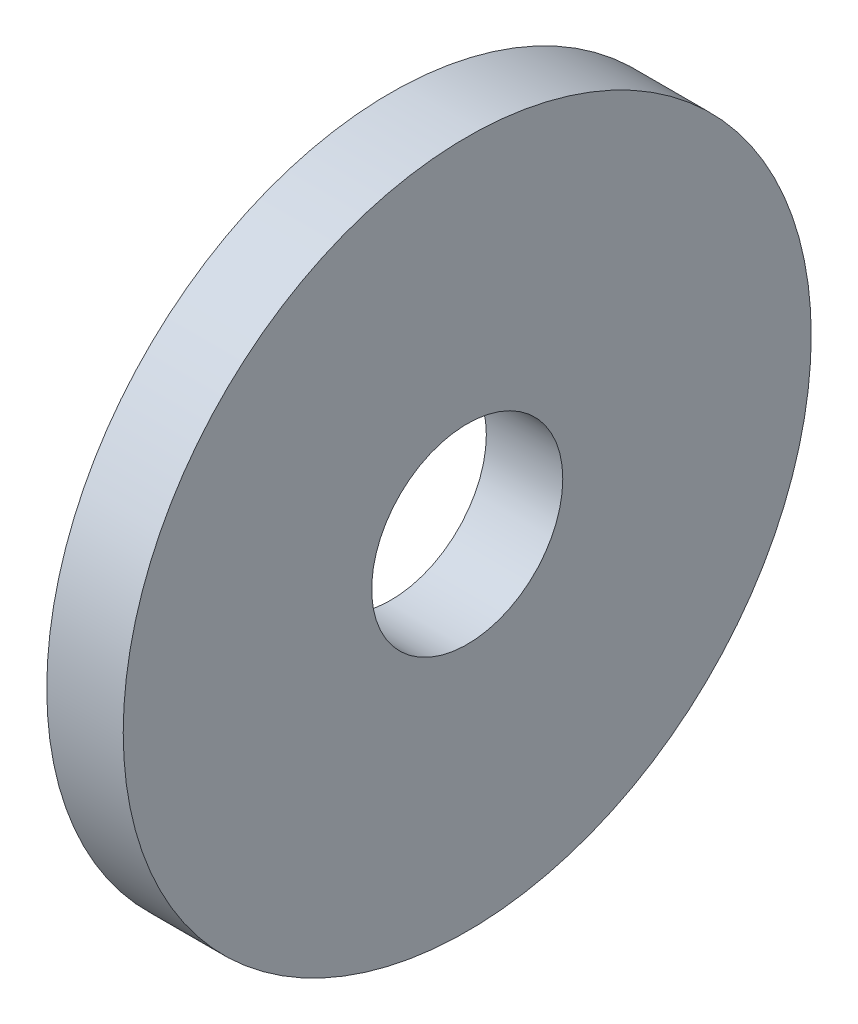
ISO-10303-21;
HEADER;
FILE_DESCRIPTION(('STEP AP214'),'2;1');
FILE_NAME('part.step','',(''),(''),'','','');
FILE_SCHEMA(('AUTOMOTIVE_DESIGN { 1 0 10303 214 1 1 1 1 }'));
ENDSEC;
DATA;
#1=APPLICATION_CONTEXT('core data for automotive mechanical design processes');
#2=APPLICATION_PROTOCOL_DEFINITION('international standard','automotive_design',2000,#1);
#3=PRODUCT_CONTEXT('',#1,'mechanical');
#4=PRODUCT('Part','Part','',(#3));
#5=PRODUCT_RELATED_PRODUCT_CATEGORY('part','',(#4));
#6=PRODUCT_DEFINITION_FORMATION('','',#4);
#7=PRODUCT_DEFINITION_CONTEXT('part definition',#1,'design');
#8=PRODUCT_DEFINITION('design','',#6,#7);
#9=PRODUCT_DEFINITION_SHAPE('','',#8);
#10=(LENGTH_UNIT() NAMED_UNIT(*) SI_UNIT(.MILLI.,.METRE.));
#11=(NAMED_UNIT(*) PLANE_ANGLE_UNIT() SI_UNIT($,.RADIAN.));
#12=(NAMED_UNIT(*) SI_UNIT($,.STERADIAN.) SOLID_ANGLE_UNIT());
#13=UNCERTAINTY_MEASURE_WITH_UNIT(LENGTH_MEASURE(1.E-05),#10,'distance_accuracy_value','');
#14=(GEOMETRIC_REPRESENTATION_CONTEXT(3) GLOBAL_UNCERTAINTY_ASSIGNED_CONTEXT((#13)) GLOBAL_UNIT_ASSIGNED_CONTEXT((#10,
#11,#12)) REPRESENTATION_CONTEXT('',''));
#15=CARTESIAN_POINT('',(0.,0.,0.));
#16=DIRECTION('',(0.,0.,1.));
#17=DIRECTION('',(1.,0.,0.));
#18=AXIS2_PLACEMENT_3D('',#15,#16,#17);
#19=CARTESIAN_POINT('',(1.,0.,0.));
#20=DIRECTION('',(1.,0.,0.));
#21=DIRECTION('',(0.,0.,-1.));
#22=AXIS2_PLACEMENT_3D('',#19,#20,#21);
#23=PLANE('',#22);
#24=CARTESIAN_POINT('',(1.,0.,0.));
#25=DIRECTION('',(1.,0.,0.));
#26=DIRECTION('',(0.,0.,-1.));
#27=AXIS2_PLACEMENT_3D('',#24,#25,#26);
#28=CIRCLE('',#27,4.5);
#29=CARTESIAN_POINT('',(1.,0.,-4.5));
#30=VERTEX_POINT('',#29);
#31=EDGE_CURVE('E10',#30,#30,#28,.T.);
#32=ORIENTED_EDGE('',*,*,#31,.T.);
#33=EDGE_LOOP('',(#32));
#34=FACE_BOUND('',#33,.T.);
#35=CARTESIAN_POINT('',(1.,0.,0.));
#36=DIRECTION('',(1.,0.,0.));
#37=DIRECTION('',(0.,0.,-1.));
#38=AXIS2_PLACEMENT_3D('',#35,#36,#37);
#39=CIRCLE('',#38,1.25);
#40=CARTESIAN_POINT('',(1.,0.,-1.25));
#41=VERTEX_POINT('',#40);
#42=EDGE_CURVE('E46',#41,#41,#39,.T.);
#43=ORIENTED_EDGE('',*,*,#42,.F.);
#44=EDGE_LOOP('',(#43));
#45=FACE_BOUND('',#44,.T.);
#46=ADVANCED_FACE('F35',(#34,#45),#23,.T.);
#47=CARTESIAN_POINT('',(0.,0.,0.));
#48=DIRECTION('',(1.,0.,0.));
#49=DIRECTION('',(0.,0.,-1.));
#50=AXIS2_PLACEMENT_3D('',#47,#48,#49);
#51=PLANE('',#50);
#52=CARTESIAN_POINT('',(0.,0.,0.));
#53=DIRECTION('',(1.,0.,0.));
#54=DIRECTION('',(0.,0.,-1.));
#55=AXIS2_PLACEMENT_3D('',#52,#53,#54);
#56=CIRCLE('',#55,4.5);
#57=CARTESIAN_POINT('',(0.,0.,-4.5));
#58=VERTEX_POINT('',#57);
#59=EDGE_CURVE('E39',#58,#58,#56,.T.);
#60=ORIENTED_EDGE('',*,*,#59,.F.);
#61=EDGE_LOOP('',(#60));
#62=FACE_BOUND('',#61,.T.);
#63=CARTESIAN_POINT('',(0.,0.,0.));
#64=DIRECTION('',(1.,0.,0.));
#65=DIRECTION('',(0.,0.,-1.));
#66=AXIS2_PLACEMENT_3D('',#63,#64,#65);
#67=CIRCLE('',#66,1.25);
#68=CARTESIAN_POINT('',(0.,0.,-1.25));
#69=VERTEX_POINT('',#68);
#70=EDGE_CURVE('E48',#69,#69,#67,.T.);
#71=ORIENTED_EDGE('',*,*,#70,.T.);
#72=EDGE_LOOP('',(#71));
#73=FACE_BOUND('',#72,.T.);
#74=ADVANCED_FACE('F58',(#62,#73),#51,.F.);
#75=CARTESIAN_POINT('',(1.,0.,0.));
#76=DIRECTION('',(-1.,0.,0.));
#77=DIRECTION('',(0.,0.,1.));
#78=AXIS2_PLACEMENT_3D('',#75,#76,#77);
#79=CYLINDRICAL_SURFACE('',#78,4.5);
#80=ORIENTED_EDGE('',*,*,#31,.F.);
#81=EDGE_LOOP('',(#80));
#82=FACE_BOUND('',#81,.T.);
#83=ORIENTED_EDGE('',*,*,#59,.T.);
#84=EDGE_LOOP('',(#83));
#85=FACE_BOUND('',#84,.T.);
#86=ADVANCED_FACE('F37',(#82,#85),#79,.T.);
#87=CARTESIAN_POINT('',(1.,0.,0.));
#88=DIRECTION('',(-1.,0.,0.));
#89=DIRECTION('',(0.,0.,1.));
#90=AXIS2_PLACEMENT_3D('',#87,#88,#89);
#91=CYLINDRICAL_SURFACE('',#90,1.25);
#92=ORIENTED_EDGE('',*,*,#42,.T.);
#93=EDGE_LOOP('',(#92));
#94=FACE_BOUND('',#93,.T.);
#95=ORIENTED_EDGE('',*,*,#70,.F.);
#96=EDGE_LOOP('',(#95));
#97=FACE_BOUND('',#96,.T.);
#98=ADVANCED_FACE('F54',(#94,#97),#91,.F.);
#99=CLOSED_SHELL('',(#46,#74,#86,#98));
#100=MANIFOLD_SOLID_BREP('B2',#99);
#101=ADVANCED_BREP_SHAPE_REPRESENTATION('',(#18,#100),#14);
#102=SHAPE_DEFINITION_REPRESENTATION(#9,#101);
ENDSEC;
END-ISO-10303-21;
